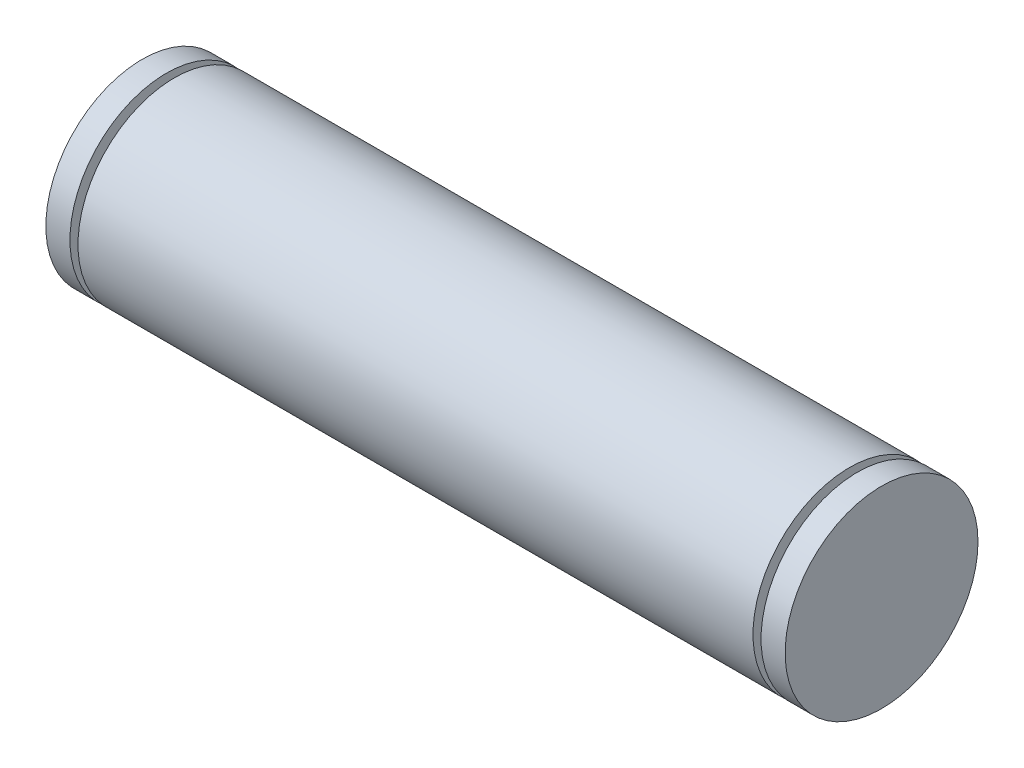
ISO-10303-21;
HEADER;
FILE_DESCRIPTION(('STEP AP214'),'2;1');
FILE_NAME('part.step','',(''),(''),'','','');
FILE_SCHEMA(('AUTOMOTIVE_DESIGN { 1 0 10303 214 1 1 1 1 }'));
ENDSEC;
DATA;
#1=APPLICATION_CONTEXT('core data for automotive mechanical design processes');
#2=APPLICATION_PROTOCOL_DEFINITION('international standard','automotive_design',2000,#1);
#3=PRODUCT_CONTEXT('',#1,'mechanical');
#4=PRODUCT('Part','Part','',(#3));
#5=PRODUCT_RELATED_PRODUCT_CATEGORY('part','',(#4));
#6=PRODUCT_DEFINITION_FORMATION('','',#4);
#7=PRODUCT_DEFINITION_CONTEXT('part definition',#1,'design');
#8=PRODUCT_DEFINITION('design','',#6,#7);
#9=PRODUCT_DEFINITION_SHAPE('','',#8);
#10=(LENGTH_UNIT() NAMED_UNIT(*) SI_UNIT(.MILLI.,.METRE.));
#11=(NAMED_UNIT(*) PLANE_ANGLE_UNIT() SI_UNIT($,.RADIAN.));
#12=(NAMED_UNIT(*) SI_UNIT($,.STERADIAN.) SOLID_ANGLE_UNIT());
#13=UNCERTAINTY_MEASURE_WITH_UNIT(LENGTH_MEASURE(1.E-05),#10,'distance_accuracy_value','');
#14=(GEOMETRIC_REPRESENTATION_CONTEXT(3) GLOBAL_UNCERTAINTY_ASSIGNED_CONTEXT((#13)) GLOBAL_UNIT_ASSIGNED_CONTEXT((#10,
#11,#12)) REPRESENTATION_CONTEXT('',''));
#15=CARTESIAN_POINT('',(0.,0.,0.));
#16=DIRECTION('',(0.,0.,1.));
#17=DIRECTION('',(1.,0.,0.));
#18=AXIS2_PLACEMENT_3D('',#15,#16,#17);
#19=CARTESIAN_POINT('',(36.5125,0.,0.));
#20=DIRECTION('',(-1.,0.,0.));
#21=DIRECTION('',(0.,0.,1.));
#22=AXIS2_PLACEMENT_3D('',#19,#20,#21);
#23=CYLINDRICAL_SURFACE('',#22,9.525);
#24=CARTESIAN_POINT('',(-33.3375,0.,0.));
#25=DIRECTION('',(1.,0.,0.));
#26=DIRECTION('',(0.,0.,-1.));
#27=AXIS2_PLACEMENT_3D('',#24,#25,#26);
#28=CIRCLE('',#27,9.525);
#29=CARTESIAN_POINT('',(-33.3375,0.,-9.525));
#30=VERTEX_POINT('',#29);
#31=EDGE_CURVE('E70',#30,#30,#28,.T.);
#32=ORIENTED_EDGE('',*,*,#31,.T.);
#33=EDGE_LOOP('',(#32));
#34=FACE_BOUND('',#33,.T.);
#35=CARTESIAN_POINT('',(33.3375,0.,0.));
#36=DIRECTION('',(1.,0.,0.));
#37=DIRECTION('',(0.,0.,-1.));
#38=AXIS2_PLACEMENT_3D('',#35,#36,#37);
#39=CIRCLE('',#38,9.525);
#40=CARTESIAN_POINT('',(33.3375,0.,-9.525));
#41=VERTEX_POINT('',#40);
#42=EDGE_CURVE('E86',#41,#41,#39,.T.);
#43=ORIENTED_EDGE('',*,*,#42,.F.);
#44=EDGE_LOOP('',(#43));
#45=FACE_BOUND('',#44,.T.);
#46=ADVANCED_FACE('F55',(#34,#45),#23,.T.);
#47=CARTESIAN_POINT('',(-36.5125,0.,0.));
#48=DIRECTION('',(1.,0.,0.));
#49=DIRECTION('',(0.,0.,-1.));
#50=AXIS2_PLACEMENT_3D('',#47,#48,#49);
#51=CIRCLE('',#50,9.525);
#52=CARTESIAN_POINT('',(-36.5125,0.,-9.525));
#53=VERTEX_POINT('',#52);
#54=EDGE_CURVE('E59',#53,#53,#51,.T.);
#55=ORIENTED_EDGE('',*,*,#54,.T.);
#56=EDGE_LOOP('',(#55));
#57=FACE_BOUND('',#56,.T.);
#58=CARTESIAN_POINT('',(-34.13125,0.,0.));
#59=DIRECTION('',(1.,0.,0.));
#60=DIRECTION('',(0.,0.,-1.));
#61=AXIS2_PLACEMENT_3D('',#58,#59,#60);
#62=CIRCLE('',#61,9.525);
#63=CARTESIAN_POINT('',(-34.13125,0.,-9.525));
#64=VERTEX_POINT('',#63);
#65=EDGE_CURVE('E68',#64,#64,#62,.T.);
#66=ORIENTED_EDGE('',*,*,#65,.F.);
#67=EDGE_LOOP('',(#66));
#68=FACE_BOUND('',#67,.T.);
#69=ADVANCED_FACE('F123',(#57,#68),#23,.T.);
#70=CARTESIAN_POINT('',(-36.5125,0.,0.));
#71=DIRECTION('',(1.,0.,0.));
#72=DIRECTION('',(0.,0.,-1.));
#73=AXIS2_PLACEMENT_3D('',#70,#71,#72);
#74=PLANE('',#73);
#75=ORIENTED_EDGE('',*,*,#54,.F.);
#76=EDGE_LOOP('',(#75));
#77=FACE_BOUND('',#76,.T.);
#78=ADVANCED_FACE('F129',(#77),#74,.F.);
#79=CARTESIAN_POINT('',(-34.13125,0.,0.));
#80=DIRECTION('',(1.,0.,0.));
#81=DIRECTION('',(0.,0.,-1.));
#82=AXIS2_PLACEMENT_3D('',#79,#80,#81);
#83=PLANE('',#82);
#84=CARTESIAN_POINT('',(-34.13125,0.,0.));
#85=DIRECTION('',(1.,0.,0.));
#86=DIRECTION('',(0.,0.,-1.));
#87=AXIS2_PLACEMENT_3D('',#84,#85,#86);
#88=CIRCLE('',#87,7.62);
#89=CARTESIAN_POINT('',(-34.13125,0.,-7.62));
#90=VERTEX_POINT('',#89);
#91=EDGE_CURVE('E74',#90,#90,#88,.T.);
#92=ORIENTED_EDGE('',*,*,#91,.F.);
#93=EDGE_LOOP('',(#92));
#94=FACE_BOUND('',#93,.T.);
#95=ORIENTED_EDGE('',*,*,#65,.T.);
#96=EDGE_LOOP('',(#95));
#97=FACE_BOUND('',#96,.T.);
#98=ADVANCED_FACE('F146',(#94,#97),#83,.T.);
#99=CARTESIAN_POINT('',(-33.3375,0.,0.));
#100=DIRECTION('',(1.,0.,0.));
#101=DIRECTION('',(0.,0.,-1.));
#102=AXIS2_PLACEMENT_3D('',#99,#100,#101);
#103=PLANE('',#102);
#104=CARTESIAN_POINT('',(-33.3375,0.,0.));
#105=DIRECTION('',(1.,0.,0.));
#106=DIRECTION('',(0.,0.,-1.));
#107=AXIS2_PLACEMENT_3D('',#104,#105,#106);
#108=CIRCLE('',#107,7.62);
#109=CARTESIAN_POINT('',(-33.3375,0.,-7.62));
#110=VERTEX_POINT('',#109);
#111=EDGE_CURVE('E78',#110,#110,#108,.T.);
#112=ORIENTED_EDGE('',*,*,#111,.T.);
#113=EDGE_LOOP('',(#112));
#114=FACE_BOUND('',#113,.T.);
#115=ORIENTED_EDGE('',*,*,#31,.F.);
#116=EDGE_LOOP('',(#115));
#117=FACE_BOUND('',#116,.T.);
#118=ADVANCED_FACE('F144',(#114,#117),#103,.F.);
#119=CARTESIAN_POINT('',(-34.13125,0.,0.));
#120=DIRECTION('',(1.,0.,0.));
#121=DIRECTION('',(0.,0.,-1.));
#122=AXIS2_PLACEMENT_3D('',#119,#120,#121);
#123=CYLINDRICAL_SURFACE('',#122,7.62);
#124=ORIENTED_EDGE('',*,*,#91,.T.);
#125=EDGE_LOOP('',(#124));
#126=FACE_BOUND('',#125,.T.);
#127=ORIENTED_EDGE('',*,*,#111,.F.);
#128=EDGE_LOOP('',(#127));
#129=FACE_BOUND('',#128,.T.);
#130=ADVANCED_FACE('F118',(#126,#129),#123,.T.);
#131=CARTESIAN_POINT('',(34.13125,0.,0.));
#132=DIRECTION('',(1.,0.,0.));
#133=DIRECTION('',(0.,0.,-1.));
#134=AXIS2_PLACEMENT_3D('',#131,#132,#133);
#135=PLANE('',#134);
#136=CARTESIAN_POINT('',(34.13125,0.,0.));
#137=DIRECTION('',(1.,0.,0.));
#138=DIRECTION('',(0.,0.,-1.));
#139=AXIS2_PLACEMENT_3D('',#136,#137,#138);
#140=CIRCLE('',#139,9.525);
#141=CARTESIAN_POINT('',(34.13125,0.,-9.525));
#142=VERTEX_POINT('',#141);
#143=EDGE_CURVE('E82',#142,#142,#140,.T.);
#144=ORIENTED_EDGE('',*,*,#143,.F.);
#145=EDGE_LOOP('',(#144));
#146=FACE_BOUND('',#145,.T.);
#147=CARTESIAN_POINT('',(34.13125,0.,0.));
#148=DIRECTION('',(1.,0.,0.));
#149=DIRECTION('',(0.,0.,-1.));
#150=AXIS2_PLACEMENT_3D('',#147,#148,#149);
#151=CIRCLE('',#150,7.62);
#152=CARTESIAN_POINT('',(34.13125,0.,-7.62));
#153=VERTEX_POINT('',#152);
#154=EDGE_CURVE('E90',#153,#153,#151,.T.);
#155=ORIENTED_EDGE('',*,*,#154,.T.);
#156=EDGE_LOOP('',(#155));
#157=FACE_BOUND('',#156,.T.);
#158=ADVANCED_FACE('F102',(#146,#157),#135,.F.);
#159=CARTESIAN_POINT('',(33.3375,0.,0.));
#160=DIRECTION('',(1.,0.,0.));
#161=DIRECTION('',(0.,0.,-1.));
#162=AXIS2_PLACEMENT_3D('',#159,#160,#161);
#163=PLANE('',#162);
#164=ORIENTED_EDGE('',*,*,#42,.T.);
#165=EDGE_LOOP('',(#164));
#166=FACE_BOUND('',#165,.T.);
#167=CARTESIAN_POINT('',(33.3375,0.,0.));
#168=DIRECTION('',(1.,0.,0.));
#169=DIRECTION('',(0.,0.,-1.));
#170=AXIS2_PLACEMENT_3D('',#167,#168,#169);
#171=CIRCLE('',#170,7.62);
#172=CARTESIAN_POINT('',(33.3375,0.,-7.62));
#173=VERTEX_POINT('',#172);
#174=EDGE_CURVE('E94',#173,#173,#171,.T.);
#175=ORIENTED_EDGE('',*,*,#174,.F.);
#176=EDGE_LOOP('',(#175));
#177=FACE_BOUND('',#176,.T.);
#178=ADVANCED_FACE('F108',(#166,#177),#163,.T.);
#179=CARTESIAN_POINT('',(34.13125,0.,0.));
#180=DIRECTION('',(-1.,0.,0.));
#181=DIRECTION('',(0.,0.,1.));
#182=AXIS2_PLACEMENT_3D('',#179,#180,#181);
#183=CYLINDRICAL_SURFACE('',#182,7.62);
#184=ORIENTED_EDGE('',*,*,#154,.F.);
#185=EDGE_LOOP('',(#184));
#186=FACE_BOUND('',#185,.T.);
#187=ORIENTED_EDGE('',*,*,#174,.T.);
#188=EDGE_LOOP('',(#187));
#189=FACE_BOUND('',#188,.T.);
#190=ADVANCED_FACE('F104',(#186,#189),#183,.T.);
#191=CARTESIAN_POINT('',(36.5125,0.,0.));
#192=DIRECTION('',(1.,0.,0.));
#193=DIRECTION('',(0.,0.,-1.));
#194=AXIS2_PLACEMENT_3D('',#191,#192,#193);
#195=PLANE('',#194);
#196=CARTESIAN_POINT('',(36.5125,0.,0.));
#197=DIRECTION('',(1.,0.,0.));
#198=DIRECTION('',(0.,0.,-1.));
#199=AXIS2_PLACEMENT_3D('',#196,#197,#198);
#200=CIRCLE('',#199,9.525);
#201=CARTESIAN_POINT('',(36.5125,0.,-9.525));
#202=VERTEX_POINT('',#201);
#203=EDGE_CURVE('E11',#202,#202,#200,.T.);
#204=ORIENTED_EDGE('',*,*,#203,.T.);
#205=EDGE_LOOP('',(#204));
#206=FACE_BOUND('',#205,.T.);
#207=ADVANCED_FACE('F107',(#206),#195,.T.);
#208=ORIENTED_EDGE('',*,*,#143,.T.);
#209=EDGE_LOOP('',(#208));
#210=FACE_BOUND('',#209,.T.);
#211=ORIENTED_EDGE('',*,*,#203,.F.);
#212=EDGE_LOOP('',(#211));
#213=FACE_BOUND('',#212,.T.);
#214=ADVANCED_FACE('F57',(#210,#213),#23,.T.);
#215=CLOSED_SHELL('',(#46,#69,#78,#98,#118,#130,#158,#178,#190,#207,#214));
#216=MANIFOLD_SOLID_BREP('B2',#215);
#217=ADVANCED_BREP_SHAPE_REPRESENTATION('',(#18,#216),#14);
#218=SHAPE_DEFINITION_REPRESENTATION(#9,#217);
ENDSEC;
END-ISO-10303-21;
